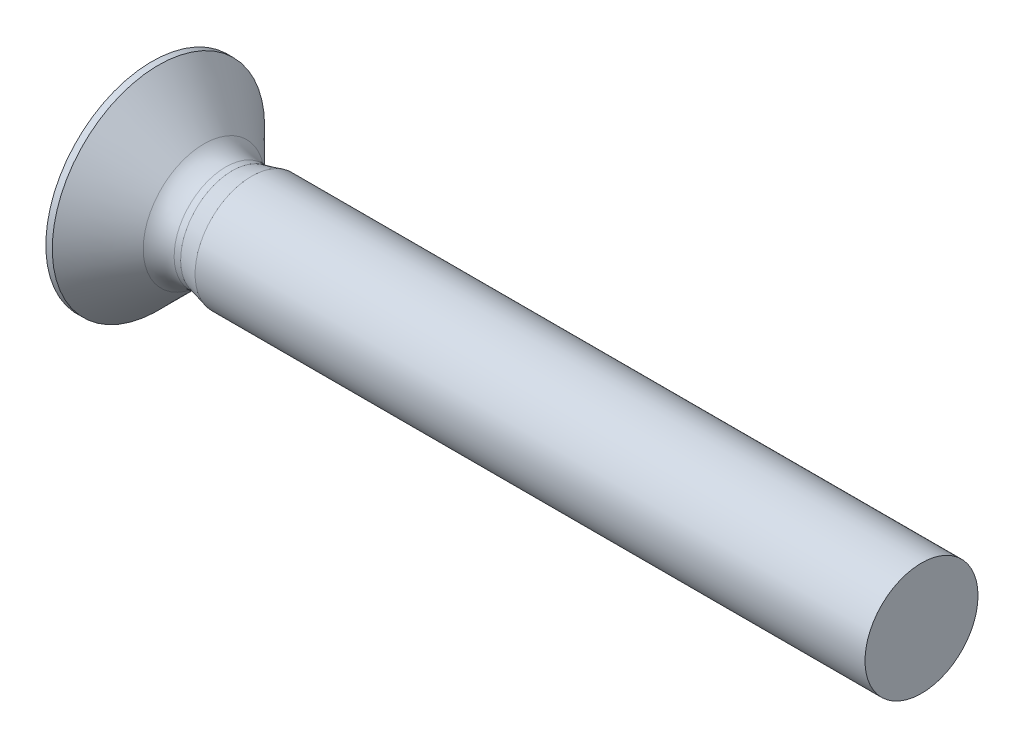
ISO-10303-21;
HEADER;
FILE_DESCRIPTION(('STEP AP214'),'2;1');
FILE_NAME('part.step','',(''),(''),'','','');
FILE_SCHEMA(('AUTOMOTIVE_DESIGN { 1 0 10303 214 1 1 1 1 }'));
ENDSEC;
DATA;
#1=APPLICATION_CONTEXT('core data for automotive mechanical design processes');
#2=APPLICATION_PROTOCOL_DEFINITION('international standard','automotive_design',2000,#1);
#3=PRODUCT_CONTEXT('',#1,'mechanical');
#4=PRODUCT('Part','Part','',(#3));
#5=PRODUCT_RELATED_PRODUCT_CATEGORY('part','',(#4));
#6=PRODUCT_DEFINITION_FORMATION('','',#4);
#7=PRODUCT_DEFINITION_CONTEXT('part definition',#1,'design');
#8=PRODUCT_DEFINITION('design','',#6,#7);
#9=PRODUCT_DEFINITION_SHAPE('','',#8);
#10=(LENGTH_UNIT() NAMED_UNIT(*) SI_UNIT(.MILLI.,.METRE.));
#11=(NAMED_UNIT(*) PLANE_ANGLE_UNIT() SI_UNIT($,.RADIAN.));
#12=(NAMED_UNIT(*) SI_UNIT($,.STERADIAN.) SOLID_ANGLE_UNIT());
#13=UNCERTAINTY_MEASURE_WITH_UNIT(LENGTH_MEASURE(1.E-05),#10,'distance_accuracy_value','');
#14=(GEOMETRIC_REPRESENTATION_CONTEXT(3) GLOBAL_UNCERTAINTY_ASSIGNED_CONTEXT((#13)) GLOBAL_UNIT_ASSIGNED_CONTEXT((#10,
#11,#12)) REPRESENTATION_CONTEXT('',''));
#15=CARTESIAN_POINT('',(0.,0.,0.));
#16=DIRECTION('',(0.,0.,1.));
#17=DIRECTION('',(1.,0.,0.));
#18=AXIS2_PLACEMENT_3D('',#15,#16,#17);
#19=CARTESIAN_POINT('',(-43.4,15.775,15.5));
#20=DIRECTION('',(0.,-1.,0.));
#21=DIRECTION('',(0.,0.,-1.));
#22=AXIS2_PLACEMENT_3D('',#19,#20,#21);
#23=PLANE('',#22);
#24=CARTESIAN_POINT('',(-44.016003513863,15.775,15.225));
#25=CARTESIAN_POINT('',(-44.0105239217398,15.775,15.1106534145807));
#26=CARTESIAN_POINT('',(-44.000493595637,15.775,14.996615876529));
#27=B_SPLINE_CURVE_WITH_KNOTS('',2,(#24,#25,#26),.UNSPECIFIED.,.F.,.F.,(3,3),(0.,1.),.UNSPECIFIED.);
#28=CARTESIAN_POINT('',(-44.016003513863,15.775,15.225));
#29=VERTEX_POINT('',#28);
#30=CARTESIAN_POINT('',(-44.0004935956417,15.775,14.9966158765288));
#31=VERTEX_POINT('',#30);
#32=EDGE_CURVE('E86',#29,#31,#27,.T.);
#33=ORIENTED_EDGE('',*,*,#32,.T.);
#34=CARTESIAN_POINT('',(-44.0004935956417,15.775,14.9966158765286));
#35=CARTESIAN_POINT('',(-43.9853538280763,15.775,14.8248425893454));
#36=CARTESIAN_POINT('',(-43.96261849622,15.775,14.6544321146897));
#37=CARTESIAN_POINT('',(-43.9019567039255,15.775,14.3163367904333));
#38=CARTESIAN_POINT('',(-43.8640302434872,15.775,14.1486519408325));
#39=CARTESIAN_POINT('',(-43.818508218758,15.775,13.9823299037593));
#40=B_SPLINE_CURVE_WITH_KNOTS('',3,(#34,#35,#36,#37,#38,#39),.UNSPECIFIED.,.F.,.F.,(4,2,4),(0.,
0.515761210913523,1.03152242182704),.UNSPECIFIED.);
#41=CARTESIAN_POINT('',(-43.8185082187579,15.7750000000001,13.9823299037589));
#42=VERTEX_POINT('',#41);
#43=EDGE_CURVE('E21',#31,#42,#40,.T.);
#44=ORIENTED_EDGE('',*,*,#43,.T.);
#45=DIRECTION('',(0.839314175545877,0.,0.54364668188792));
#46=VECTOR('',#45,1.);
#47=CARTESIAN_POINT('',(-41.9,15.775,15.225));
#48=LINE('',#47,#46);
#49=CARTESIAN_POINT('',(-41.9,15.775,15.225));
#50=VERTEX_POINT('',#49);
#51=EDGE_CURVE('E99',#50,#42,#48,.F.);
#52=ORIENTED_EDGE('',*,*,#51,.F.);
#53=DIRECTION('',(1.,0.,0.));
#54=VECTOR('',#53,1.);
#55=CARTESIAN_POINT('',(-43.4,15.775,15.225));
#56=LINE('',#55,#54);
#57=EDGE_CURVE('E97',#50,#29,#56,.F.);
#58=ORIENTED_EDGE('',*,*,#57,.T.);
#59=EDGE_LOOP('',(#33,#44,#52,#58));
#60=FACE_BOUND('',#59,.T.);
#61=ADVANCED_FACE('F17',(#60),#23,.T.);
#62=CARTESIAN_POINT('',(-41.9,15.5,15.225));
#63=DIRECTION('',(-0.54364668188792,0.,0.839314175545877));
#64=DIRECTION('',(0.839314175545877,0.,0.54364668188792));
#65=AXIS2_PLACEMENT_3D('',#62,#63,#64);
#66=PLANE('',#65);
#67=ORIENTED_EDGE('',*,*,#51,.T.);
#68=CARTESIAN_POINT('',(-43.8185082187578,15.7750000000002,13.9823299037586));
#69=CARTESIAN_POINT('',(-43.8223696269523,15.6833333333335,13.9798287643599));
#70=CARTESIAN_POINT('',(-43.8243003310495,15.5916666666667,13.9785781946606));
#71=CARTESIAN_POINT('',(-43.8243003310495,15.4083333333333,13.9785781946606));
#72=CARTESIAN_POINT('',(-43.8223696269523,15.3166666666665,13.9798287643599));
#73=CARTESIAN_POINT('',(-43.8185082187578,15.2249999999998,13.9823299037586));
#74=B_SPLINE_CURVE_WITH_KNOTS('',3,(#68,#69,#70,#71,#72,#73),.UNSPECIFIED.,.F.,.F.,(4,2,4),(0.,
0.27508657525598,0.550173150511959),.UNSPECIFIED.);
#75=CARTESIAN_POINT('',(-43.8185082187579,15.2249999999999,13.9823299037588));
#76=VERTEX_POINT('',#75);
#77=EDGE_CURVE('E103',#42,#76,#74,.T.);
#78=ORIENTED_EDGE('',*,*,#77,.T.);
#79=DIRECTION('',(0.839314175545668,0.,0.543646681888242));
#80=VECTOR('',#79,1.);
#81=CARTESIAN_POINT('',(-43.818508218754,15.225,13.98232990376));
#82=LINE('',#81,#80);
#83=CARTESIAN_POINT('',(-41.9000000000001,15.2250000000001,15.225));
#84=VERTEX_POINT('',#83);
#85=EDGE_CURVE('E108',#76,#84,#82,.T.);
#86=ORIENTED_EDGE('',*,*,#85,.T.);
#87=DIRECTION('',(0.,1.,0.));
#88=VECTOR('',#87,1.);
#89=CARTESIAN_POINT('',(-41.9,15.5,15.225));
#90=LINE('',#89,#88);
#91=EDGE_CURVE('E230',#84,#50,#90,.T.);
#92=ORIENTED_EDGE('',*,*,#91,.T.);
#93=EDGE_LOOP('',(#67,#78,#86,#92));
#94=FACE_BOUND('',#93,.T.);
#95=ADVANCED_FACE('F347',(#94),#66,.T.);
#96=CARTESIAN_POINT('',(-43.4,15.5,15.225));
#97=DIRECTION('',(0.,0.,-1.));
#98=DIRECTION('',(0.,1.,0.));
#99=AXIS2_PLACEMENT_3D('',#96,#97,#98);
#100=PLANE('',#99);
#101=ORIENTED_EDGE('',*,*,#57,.F.);
#102=DIRECTION('',(0.839314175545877,-0.54364668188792,0.));
#103=VECTOR('',#102,1.);
#104=CARTESIAN_POINT('',(-41.9,15.775,15.225));
#105=LINE('',#104,#103);
#106=CARTESIAN_POINT('',(-43.8185067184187,17.0176684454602,15.225));
#107=VERTEX_POINT('',#106);
#108=EDGE_CURVE('E106',#107,#50,#105,.T.);
#109=ORIENTED_EDGE('',*,*,#108,.F.);
#110=CARTESIAN_POINT('',(-44.0160035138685,15.7750000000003,15.225));
#111=CARTESIAN_POINT('',(-44.0134825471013,15.8276109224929,15.225));
#112=CARTESIAN_POINT('',(-44.0102377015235,15.8801871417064,15.225));
#113=CARTESIAN_POINT('',(-44.0023124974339,15.9851122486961,15.225));
#114=CARTESIAN_POINT('',(-43.9976353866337,16.037461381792,15.225));
#115=CARTESIAN_POINT('',(-43.9868546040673,16.1419331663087,15.225));
#116=CARTESIAN_POINT('',(-43.9807530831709,16.1940560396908,15.225));
#117=CARTESIAN_POINT('',(-43.967129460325,16.2980759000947,15.225));
#118=CARTESIAN_POINT('',(-43.9596084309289,16.3499730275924,15.225));
#119=CARTESIAN_POINT('',(-43.9431484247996,16.4535419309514,15.225));
#120=CARTESIAN_POINT('',(-43.9342094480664,16.5052137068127,15.225));
#121=CARTESIAN_POINT('',(-43.9149130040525,16.6083319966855,15.225));
#122=CARTESIAN_POINT('',(-43.904554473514,16.6597783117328,15.225));
#123=CARTESIAN_POINT('',(-43.8824151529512,16.7624449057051,15.225));
#124=CARTESIAN_POINT('',(-43.8706322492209,16.8136647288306,15.225));
#125=CARTESIAN_POINT('',(-43.8456375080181,16.915877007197,15.225));
#126=CARTESIAN_POINT('',(-43.8324225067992,16.9668686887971,15.225));
#127=CARTESIAN_POINT('',(-43.818508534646,17.0176689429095,15.225));
#128=B_SPLINE_CURVE_WITH_KNOTS('',3,(#110,#111,#112,#113,#114,#115,#116,#117,#118,#119,#120,
#121,#122,#123,#124,#125,#126,#127),.UNSPECIFIED.,.F.,.F.,(4,2,2,2,2,2,2,2,4),(0.,
0.158008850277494,0.3156620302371,0.473078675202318,0.630376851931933,0.787675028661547,
0.945091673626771,1.10274485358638,1.26075370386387),.UNSPECIFIED.);
#129=EDGE_CURVE('E91',#29,#107,#128,.T.);
#130=ORIENTED_EDGE('',*,*,#129,.F.);
#131=EDGE_LOOP('',(#101,#109,#130));
#132=FACE_BOUND('',#131,.T.);
#133=ADVANCED_FACE('F105',(#132),#100,.F.);
#134=CARTESIAN_POINT('',(-43.4,15.225,15.5));
#135=DIRECTION('',(0.,-1.,0.));
#136=DIRECTION('',(0.,0.,-1.));
#137=AXIS2_PLACEMENT_3D('',#134,#135,#136);
#138=PLANE('',#137);
#139=DIRECTION('',(1.,0.,0.));
#140=VECTOR('',#139,1.);
#141=CARTESIAN_POINT('',(-43.4,15.225,15.225));
#142=LINE('',#141,#140);
#143=CARTESIAN_POINT('',(-44.0160035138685,15.2249999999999,15.2249999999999));
#144=VERTEX_POINT('',#143);
#145=EDGE_CURVE('E211',#144,#84,#142,.T.);
#146=ORIENTED_EDGE('',*,*,#145,.T.);
#147=ORIENTED_EDGE('',*,*,#85,.F.);
#148=CARTESIAN_POINT('',(-44.0160035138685,15.225,15.2249999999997));
#149=CARTESIAN_POINT('',(-44.0134825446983,15.225,15.1723890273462));
#150=CARTESIAN_POINT('',(-44.0102376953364,15.225,15.1198127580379));
#151=CARTESIAN_POINT('',(-44.0023124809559,15.225,15.0148875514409));
#152=CARTESIAN_POINT('',(-43.997635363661,15.225,14.9625383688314));
#153=CARTESIAN_POINT('',(-43.9868545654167,15.225,14.8580664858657));
#154=CARTESIAN_POINT('',(-43.9807530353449,15.225,14.8059435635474));
#155=CARTESIAN_POINT('',(-43.9671293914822,15.225,14.701923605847));
#156=CARTESIAN_POINT('',(-43.9596083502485,15.225,14.6500264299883));
#157=CARTESIAN_POINT('',(-43.9431483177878,15.225,14.5464574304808));
#158=CARTESIAN_POINT('',(-43.9342093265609,15.225,14.4947856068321));
#159=CARTESIAN_POINT('',(-43.9149128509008,15.225,14.3916672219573));
#160=CARTESIAN_POINT('',(-43.904554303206,15.225,14.3402208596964));
#161=CARTESIAN_POINT('',(-43.882414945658,15.225,14.2375541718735));
#162=CARTESIAN_POINT('',(-43.8706320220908,15.225,14.1863343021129));
#163=CARTESIAN_POINT('',(-43.8456372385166,15.225,14.0841219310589));
#164=CARTESIAN_POINT('',(-43.8324222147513,15.225,14.0331302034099));
#165=CARTESIAN_POINT('',(-43.818508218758,15.225,13.9823299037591));
#166=B_SPLINE_CURVE_WITH_KNOTS('',3,(#148,#149,#150,#151,#152,#153,#154,#155,#156,#157,#158,
#159,#160,#161,#162,#163,#164,#165),.UNSPECIFIED.,.F.,.F.,(4,2,2,2,2,2,2,2,4),(0.,
0.158009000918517,0.315662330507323,0.473079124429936,0.630377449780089,0.787675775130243,
0.945092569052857,1.10274589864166,1.26075489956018),.UNSPECIFIED.);
#167=EDGE_CURVE('E111',#144,#76,#166,.T.);
#168=ORIENTED_EDGE('',*,*,#167,.F.);
#169=EDGE_LOOP('',(#146,#147,#168));
#170=FACE_BOUND('',#169,.T.);
#171=ADVANCED_FACE('F319',(#170),#138,.F.);
#172=CARTESIAN_POINT('',(-41.9,15.775,15.5));
#173=DIRECTION('',(-0.54364668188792,-0.839314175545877,0.));
#174=DIRECTION('',(0.839314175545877,-0.54364668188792,0.));
#175=AXIS2_PLACEMENT_3D('',#172,#173,#174);
#176=PLANE('',#175);
#177=DIRECTION('',(0.839314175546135,-0.543646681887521,0.));
#178=VECTOR('',#177,1.);
#179=CARTESIAN_POINT('',(-43.818504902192,17.01766794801,15.775));
#180=LINE('',#179,#178);
#181=CARTESIAN_POINT('',(-43.818506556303,17.0176690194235,15.7750000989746));
#182=VERTEX_POINT('',#181);
#183=CARTESIAN_POINT('',(-41.9000000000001,15.775,15.7749999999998));
#184=VERTEX_POINT('',#183);
#185=EDGE_CURVE('E205',#182,#184,#180,.T.);
#186=ORIENTED_EDGE('',*,*,#185,.F.);
#187=CARTESIAN_POINT('',(-43.8185082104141,17.017670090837,15.7750001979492));
#188=CARTESIAN_POINT('',(-43.822369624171,17.0201712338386,15.6833334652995));
#189=CARTESIAN_POINT('',(-43.8243003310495,17.0214218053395,15.5916667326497));
#190=CARTESIAN_POINT('',(-43.8243003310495,17.0214218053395,15.4083332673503));
#191=CARTESIAN_POINT('',(-43.822369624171,17.0201712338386,15.3166665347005));
#192=CARTESIAN_POINT('',(-43.8185082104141,17.017670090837,15.2249998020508));
#193=B_SPLINE_CURVE_WITH_KNOTS('',3,(#187,#188,#189,#190,#191,#192),.UNSPECIFIED.,.F.,.F.,(4,2,
4),(0.,0.275086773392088,0.550173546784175),.UNSPECIFIED.);
#194=EDGE_CURVE('E214',#182,#107,#193,.T.);
#195=ORIENTED_EDGE('',*,*,#194,.T.);
#196=ORIENTED_EDGE('',*,*,#108,.T.);
#197=DIRECTION('',(0.,0.,1.));
#198=VECTOR('',#197,1.);
#199=CARTESIAN_POINT('',(-41.9,15.775,15.5));
#200=LINE('',#199,#198);
#201=EDGE_CURVE('E218',#50,#184,#200,.T.);
#202=ORIENTED_EDGE('',*,*,#201,.T.);
#203=EDGE_LOOP('',(#186,#195,#196,#202));
#204=FACE_BOUND('',#203,.T.);
#205=ADVANCED_FACE('F315',(#204),#176,.T.);
#206=CARTESIAN_POINT('',(-43.4,15.5,15.225));
#207=DIRECTION('',(0.,0.,-1.));
#208=DIRECTION('',(0.,1.,0.));
#209=AXIS2_PLACEMENT_3D('',#206,#207,#208);
#210=PLANE('',#209);
#211=DIRECTION('',(-0.839314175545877,-0.54364668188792,0.));
#212=VECTOR('',#211,1.);
#213=CARTESIAN_POINT('',(-44.1,13.8,15.225));
#214=LINE('',#213,#212);
#215=CARTESIAN_POINT('',(-43.8185082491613,13.9823300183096,15.224999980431));
#216=VERTEX_POINT('',#215);
#217=EDGE_CURVE('E199',#84,#216,#214,.T.);
#218=ORIENTED_EDGE('',*,*,#217,.F.);
#219=ORIENTED_EDGE('',*,*,#145,.F.);
#220=CARTESIAN_POINT('',(-43.8185082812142,13.9823301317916,15.225));
#221=CARTESIAN_POINT('',(-43.832422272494,14.0331304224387,15.225));
#222=CARTESIAN_POINT('',(-43.8456372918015,14.0841221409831,15.225));
#223=CARTESIAN_POINT('',(-43.8706320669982,14.1863344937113,15.225));
#224=CARTESIAN_POINT('',(-43.8824149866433,14.2375543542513,15.225));
#225=CARTESIAN_POINT('',(-43.9045543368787,14.3402210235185,15.225));
#226=CARTESIAN_POINT('',(-43.9149128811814,14.3916673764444,15.225));
#227=CARTESIAN_POINT('',(-43.9342093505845,14.4947857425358,15.225));
#228=CARTESIAN_POINT('',(-43.9431483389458,14.5464575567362,15.225));
#229=CARTESIAN_POINT('',(-43.9596083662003,14.6500265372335,15.225));
#230=CARTESIAN_POINT('',(-43.9671294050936,14.7019237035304,15.225));
#231=CARTESIAN_POINT('',(-43.9807530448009,14.8059436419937,15.225));
#232=CARTESIAN_POINT('',(-43.9868545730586,14.8580665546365,15.225));
#233=CARTESIAN_POINT('',(-43.9976353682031,14.9625384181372,15.225));
#234=CARTESIAN_POINT('',(-44.0023124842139,15.0148875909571,15.225));
#235=CARTESIAN_POINT('',(-44.0102376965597,15.1198127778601,15.225));
#236=CARTESIAN_POINT('',(-44.0134825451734,15.1723890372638,15.225));
#237=CARTESIAN_POINT('',(-44.0160035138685,15.2249999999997,15.225));
#238=B_SPLINE_CURVE_WITH_KNOTS('',3,(#220,#221,#222,#223,#224,#225,#226,#227,#228,#229,#230,
#231,#232,#233,#234,#235,#236,#237),.UNSPECIFIED.,.F.,.F.,(4,2,2,2,2,2,2,2,4),(0.,
0.158008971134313,0.315662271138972,0.473079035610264,0.630377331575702,0.787675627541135,
0.945092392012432,1.10274569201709,1.26075466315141),.UNSPECIFIED.);
#239=EDGE_CURVE('E208',#216,#144,#238,.T.);
#240=ORIENTED_EDGE('',*,*,#239,.F.);
#241=EDGE_LOOP('',(#218,#219,#240));
#242=FACE_BOUND('',#241,.T.);
#243=ADVANCED_FACE('F310',(#242),#210,.F.);
#244=CARTESIAN_POINT('',(-43.4,15.5,15.775));
#245=DIRECTION('',(0.,0.,-1.));
#246=DIRECTION('',(0.,1.,0.));
#247=AXIS2_PLACEMENT_3D('',#244,#245,#246);
#248=PLANE('',#247);
#249=DIRECTION('',(1.,0.,0.));
#250=VECTOR('',#249,1.);
#251=CARTESIAN_POINT('',(-43.4,15.775,15.775));
#252=LINE('',#251,#250);
#253=CARTESIAN_POINT('',(-44.0160035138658,15.7750000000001,15.775));
#254=VERTEX_POINT('',#253);
#255=EDGE_CURVE('E193',#254,#184,#252,.T.);
#256=ORIENTED_EDGE('',*,*,#255,.F.);
#257=CARTESIAN_POINT('',(-44.0160035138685,15.7750000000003,15.775));
#258=CARTESIAN_POINT('',(-44.0134825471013,15.8276109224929,15.775));
#259=CARTESIAN_POINT('',(-44.0102377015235,15.8801871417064,15.775));
#260=CARTESIAN_POINT('',(-44.0023124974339,15.9851122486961,15.775));
#261=CARTESIAN_POINT('',(-43.9976353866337,16.037461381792,15.775));
#262=CARTESIAN_POINT('',(-43.9868546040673,16.1419331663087,15.775));
#263=CARTESIAN_POINT('',(-43.9807530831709,16.1940560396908,15.775));
#264=CARTESIAN_POINT('',(-43.967129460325,16.2980759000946,15.775));
#265=CARTESIAN_POINT('',(-43.9596084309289,16.3499730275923,15.775));
#266=CARTESIAN_POINT('',(-43.9431484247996,16.4535419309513,15.775));
#267=CARTESIAN_POINT('',(-43.9342094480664,16.5052137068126,15.775));
#268=CARTESIAN_POINT('',(-43.9149130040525,16.6083319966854,15.775));
#269=CARTESIAN_POINT('',(-43.904554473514,16.6597783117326,15.775));
#270=CARTESIAN_POINT('',(-43.8824151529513,16.7624449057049,15.775));
#271=CARTESIAN_POINT('',(-43.8706322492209,16.8136647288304,15.775));
#272=CARTESIAN_POINT('',(-43.8456375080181,16.9158770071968,15.775));
#273=CARTESIAN_POINT('',(-43.8324225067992,16.9668686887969,15.775));
#274=CARTESIAN_POINT('',(-43.8185085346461,17.0176689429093,15.775));
#275=B_SPLINE_CURVE_WITH_KNOTS('',3,(#257,#258,#259,#260,#261,#262,#263,#264,#265,#266,#267,
#268,#269,#270,#271,#272,#273,#274),.UNSPECIFIED.,.F.,.F.,(4,2,2,2,2,2,2,2,4),(0.,
0.158008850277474,0.315662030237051,0.473078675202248,0.630376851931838,0.787675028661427,
0.945091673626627,1.1027448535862,1.26075370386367),.UNSPECIFIED.);
#276=EDGE_CURVE('E202',#254,#182,#275,.T.);
#277=ORIENTED_EDGE('',*,*,#276,.T.);
#278=ORIENTED_EDGE('',*,*,#185,.T.);
#279=EDGE_LOOP('',(#256,#277,#278));
#280=FACE_BOUND('',#279,.T.);
#281=ADVANCED_FACE('F307',(#280),#248,.T.);
#282=CARTESIAN_POINT('',(-44.1,13.8,15.5));
#283=DIRECTION('',(-0.54364668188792,0.839314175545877,0.));
#284=DIRECTION('',(-0.839314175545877,-0.54364668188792,0.));
#285=AXIS2_PLACEMENT_3D('',#282,#283,#284);
#286=PLANE('',#285);
#287=ORIENTED_EDGE('',*,*,#217,.T.);
#288=CARTESIAN_POINT('',(-43.8185082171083,13.9823299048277,15.2249999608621));
#289=CARTESIAN_POINT('',(-43.8223696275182,13.979828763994,15.31666666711));
#290=CARTESIAN_POINT('',(-43.8243003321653,13.9785781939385,15.4083333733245));
#291=CARTESIAN_POINT('',(-43.824300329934,13.9785781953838,15.5916667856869));
#292=CARTESIAN_POINT('',(-43.8223696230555,13.9798287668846,15.6833334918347));
#293=CARTESIAN_POINT('',(-43.8185082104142,13.9823299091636,15.7750001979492));
#294=B_SPLINE_CURVE_WITH_KNOTS('',3,(#288,#289,#290,#291,#292,#293),.UNSPECIFIED.,.F.,.F.,(4,2,
4),(0.,0.275086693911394,0.550173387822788),.UNSPECIFIED.);
#295=CARTESIAN_POINT('',(-43.8185083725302,13.9823304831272,15.7750000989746));
#296=VERTEX_POINT('',#295);
#297=EDGE_CURVE('E196',#216,#296,#294,.T.);
#298=ORIENTED_EDGE('',*,*,#297,.T.);
#299=DIRECTION('',(-0.839314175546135,-0.543646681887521,0.));
#300=VECTOR('',#299,1.);
#301=CARTESIAN_POINT('',(-41.9,15.225,15.775));
#302=LINE('',#301,#300);
#303=CARTESIAN_POINT('',(-41.9000000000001,15.225,15.7749999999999));
#304=VERTEX_POINT('',#303);
#305=EDGE_CURVE('E182',#304,#296,#302,.T.);
#306=ORIENTED_EDGE('',*,*,#305,.F.);
#307=DIRECTION('',(0.,0.,1.));
#308=VECTOR('',#307,1.);
#309=CARTESIAN_POINT('',(-41.9,15.225,15.775));
#310=LINE('',#309,#308);
#311=EDGE_CURVE('E185',#84,#304,#310,.T.);
#312=ORIENTED_EDGE('',*,*,#311,.F.);
#313=EDGE_LOOP('',(#287,#298,#306,#312));
#314=FACE_BOUND('',#313,.T.);
#315=ADVANCED_FACE('F281',(#314),#286,.T.);
#316=CARTESIAN_POINT('',(-43.4,15.775,15.5));
#317=DIRECTION('',(0.,-1.,0.));
#318=DIRECTION('',(0.,0.,-1.));
#319=AXIS2_PLACEMENT_3D('',#316,#317,#318);
#320=PLANE('',#319);
#321=DIRECTION('',(-0.839314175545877,0.,0.54364668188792));
#322=VECTOR('',#321,1.);
#323=CARTESIAN_POINT('',(-44.1,15.775,17.2));
#324=LINE('',#323,#322);
#325=CARTESIAN_POINT('',(-43.8185082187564,15.775,17.0176700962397));
#326=VERTEX_POINT('',#325);
#327=EDGE_CURVE('E171',#326,#184,#324,.F.);
#328=ORIENTED_EDGE('',*,*,#327,.F.);
#329=CARTESIAN_POINT('',(-43.8185082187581,15.775,17.0176700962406));
#330=CARTESIAN_POINT('',(-43.8324222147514,15.775,16.9668697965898));
#331=CARTESIAN_POINT('',(-43.8456372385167,15.775,16.9158780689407));
#332=CARTESIAN_POINT('',(-43.8706320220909,15.775,16.8136656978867));
#333=CARTESIAN_POINT('',(-43.8824149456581,15.775,16.7624458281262));
#334=CARTESIAN_POINT('',(-43.904554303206,15.775,16.6597791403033));
#335=CARTESIAN_POINT('',(-43.9149128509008,15.775,16.6083327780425));
#336=CARTESIAN_POINT('',(-43.9342093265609,15.775,16.5052143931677));
#337=CARTESIAN_POINT('',(-43.9431483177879,15.775,16.4535425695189));
#338=CARTESIAN_POINT('',(-43.9596083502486,15.775,16.3499735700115));
#339=CARTESIAN_POINT('',(-43.9671293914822,15.775,16.2980763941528));
#340=CARTESIAN_POINT('',(-43.9807530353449,15.775,16.1940564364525));
#341=CARTESIAN_POINT('',(-43.9868545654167,15.775,16.1419335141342));
#342=CARTESIAN_POINT('',(-43.997635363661,15.775,16.0374616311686));
#343=CARTESIAN_POINT('',(-44.0023124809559,15.775,15.985112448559));
#344=CARTESIAN_POINT('',(-44.0102376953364,15.775,15.880187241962));
#345=CARTESIAN_POINT('',(-44.0134825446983,15.775,15.8276109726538));
#346=CARTESIAN_POINT('',(-44.0160035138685,15.775,15.7750000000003));
#347=B_SPLINE_CURVE_WITH_KNOTS('',3,(#329,#330,#331,#332,#333,#334,#335,#336,#337,#338,#339,
#340,#341,#342,#343,#344,#345,#346),.UNSPECIFIED.,.F.,.F.,(4,2,2,2,2,2,2,2,4),(0.,
0.158009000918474,0.315662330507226,0.473079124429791,0.630377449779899,0.787675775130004,
0.945092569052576,1.10274589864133,1.2607548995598),.UNSPECIFIED.);
#348=EDGE_CURVE('E190',#326,#254,#347,.T.);
#349=ORIENTED_EDGE('',*,*,#348,.T.);
#350=ORIENTED_EDGE('',*,*,#255,.T.);
#351=EDGE_LOOP('',(#328,#349,#350));
#352=FACE_BOUND('',#351,.T.);
#353=ADVANCED_FACE('F276',(#352),#320,.T.);
#354=CARTESIAN_POINT('',(-41.9,15.5,15.775));
#355=DIRECTION('',(-1.,0.,0.));
#356=DIRECTION('',(0.,0.,1.));
#357=AXIS2_PLACEMENT_3D('',#354,#355,#356);
#358=PLANE('',#357);
#359=ORIENTED_EDGE('',*,*,#91,.F.);
#360=ORIENTED_EDGE('',*,*,#311,.T.);
#361=DIRECTION('',(0.,1.,0.));
#362=VECTOR('',#361,1.);
#363=CARTESIAN_POINT('',(-41.9000000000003,15.5,15.7749999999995));
#364=LINE('',#363,#362);
#365=EDGE_CURVE('E174',#184,#304,#364,.F.);
#366=ORIENTED_EDGE('',*,*,#365,.F.);
#367=ORIENTED_EDGE('',*,*,#201,.F.);
#368=EDGE_LOOP('',(#359,#360,#366,#367));
#369=FACE_BOUND('',#368,.T.);
#370=ADVANCED_FACE('F272',(#369),#358,.T.);
#371=CARTESIAN_POINT('',(-43.4,15.5,15.775));
#372=DIRECTION('',(0.,0.,-1.));
#373=DIRECTION('',(0.,1.,0.));
#374=AXIS2_PLACEMENT_3D('',#371,#372,#373);
#375=PLANE('',#374);
#376=ORIENTED_EDGE('',*,*,#305,.T.);
#377=CARTESIAN_POINT('',(-43.8185085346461,13.9823310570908,15.775));
#378=CARTESIAN_POINT('',(-43.8324225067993,14.0331313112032,15.775));
#379=CARTESIAN_POINT('',(-43.8456375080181,14.0841229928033,15.775));
#380=CARTESIAN_POINT('',(-43.870632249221,14.1863352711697,15.775));
#381=CARTESIAN_POINT('',(-43.8824151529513,14.2375550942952,15.775));
#382=CARTESIAN_POINT('',(-43.904554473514,14.3402216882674,15.775));
#383=CARTESIAN_POINT('',(-43.9149130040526,14.3916680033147,15.775));
#384=CARTESIAN_POINT('',(-43.9342094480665,14.4947862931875,15.775));
#385=CARTESIAN_POINT('',(-43.9431484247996,14.5464580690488,15.775));
#386=CARTESIAN_POINT('',(-43.9596084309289,14.6500269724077,15.775));
#387=CARTESIAN_POINT('',(-43.9671294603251,14.7019240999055,15.775));
#388=CARTESIAN_POINT('',(-43.9807530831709,14.8059439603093,15.775));
#389=CARTESIAN_POINT('',(-43.9868546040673,14.8580668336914,15.775));
#390=CARTESIAN_POINT('',(-43.9976353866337,14.9625386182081,15.775));
#391=CARTESIAN_POINT('',(-44.0023124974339,15.0148877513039,15.775));
#392=CARTESIAN_POINT('',(-44.0102377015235,15.1198128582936,15.775));
#393=CARTESIAN_POINT('',(-44.0134825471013,15.1723890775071,15.775));
#394=CARTESIAN_POINT('',(-44.0160035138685,15.2249999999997,15.775));
#395=B_SPLINE_CURVE_WITH_KNOTS('',3,(#377,#378,#379,#380,#381,#382,#383,#384,#385,#386,#387,
#388,#389,#390,#391,#392,#393,#394),.UNSPECIFIED.,.F.,.F.,(4,2,2,2,2,2,2,2,4),(0.,
0.158008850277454,0.315662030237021,0.473078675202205,0.63037685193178,0.787675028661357,
0.94509167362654,1.1027448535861,1.26075370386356),.UNSPECIFIED.);
#396=CARTESIAN_POINT('',(-44.0160035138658,15.2249999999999,15.775));
#397=VERTEX_POINT('',#396);
#398=EDGE_CURVE('E175',#296,#397,#395,.T.);
#399=ORIENTED_EDGE('',*,*,#398,.T.);
#400=DIRECTION('',(1.,0.,0.));
#401=VECTOR('',#400,1.);
#402=CARTESIAN_POINT('',(-43.4,15.225,15.775));
#403=LINE('',#402,#401);
#404=EDGE_CURVE('E163',#397,#304,#403,.T.);
#405=ORIENTED_EDGE('',*,*,#404,.T.);
#406=EDGE_LOOP('',(#376,#399,#405));
#407=FACE_BOUND('',#406,.T.);
#408=ADVANCED_FACE('F267',(#407),#375,.T.);
#409=CARTESIAN_POINT('',(-44.1,15.5,17.2));
#410=DIRECTION('',(-0.54364668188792,0.,-0.839314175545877));
#411=DIRECTION('',(-0.839314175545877,0.,0.54364668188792));
#412=AXIS2_PLACEMENT_3D('',#409,#410,#411);
#413=PLANE('',#412);
#414=DIRECTION('',(-0.839314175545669,0.,0.543646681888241));
#415=VECTOR('',#414,1.);
#416=CARTESIAN_POINT('',(-41.9,15.225,15.775));
#417=LINE('',#416,#415);
#418=CARTESIAN_POINT('',(-43.818508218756,15.2249999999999,17.0176700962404));
#419=VERTEX_POINT('',#418);
#420=EDGE_CURVE('E155',#304,#419,#417,.T.);
#421=ORIENTED_EDGE('',*,*,#420,.T.);
#422=CARTESIAN_POINT('',(-43.818508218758,15.2249999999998,17.0176700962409));
#423=CARTESIAN_POINT('',(-43.8223696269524,15.3166666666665,17.0201712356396));
#424=CARTESIAN_POINT('',(-43.8243003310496,15.4083333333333,17.0214218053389));
#425=CARTESIAN_POINT('',(-43.8243003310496,15.5916666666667,17.0214218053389));
#426=CARTESIAN_POINT('',(-43.8223696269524,15.6833333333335,17.0201712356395));
#427=CARTESIAN_POINT('',(-43.818508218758,15.7750000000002,17.0176700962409));
#428=B_SPLINE_CURVE_WITH_KNOTS('',3,(#422,#423,#424,#425,#426,#427),.UNSPECIFIED.,.F.,.F.,(4,2,
4),(0.,0.275086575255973,0.550173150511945),.UNSPECIFIED.);
#429=EDGE_CURVE('E168',#419,#326,#428,.T.);
#430=ORIENTED_EDGE('',*,*,#429,.T.);
#431=ORIENTED_EDGE('',*,*,#327,.T.);
#432=ORIENTED_EDGE('',*,*,#365,.T.);
#433=EDGE_LOOP('',(#421,#430,#431,#432));
#434=FACE_BOUND('',#433,.T.);
#435=ADVANCED_FACE('F264',(#434),#413,.T.);
#436=CARTESIAN_POINT('',(-43.4,15.225,15.5));
#437=DIRECTION('',(0.,-1.,0.));
#438=DIRECTION('',(0.,0.,-1.));
#439=AXIS2_PLACEMENT_3D('',#436,#437,#438);
#440=PLANE('',#439);
#441=CARTESIAN_POINT('',(-43.818508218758,15.225,17.0176700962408));
#442=CARTESIAN_POINT('',(-43.8640302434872,15.225,16.8513480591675));
#443=CARTESIAN_POINT('',(-43.9019567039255,15.225,16.6836632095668));
#444=CARTESIAN_POINT('',(-43.96261849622,15.225,16.3455678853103));
#445=CARTESIAN_POINT('',(-43.9853538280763,15.225,16.1751574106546));
#446=CARTESIAN_POINT('',(-44.0004935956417,15.225,16.0033841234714));
#447=B_SPLINE_CURVE_WITH_KNOTS('',3,(#441,#442,#443,#444,#445,#446),.UNSPECIFIED.,.F.,.F.,(4,2,
4),(0.,0.515761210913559,1.03152242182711),.UNSPECIFIED.);
#448=CARTESIAN_POINT('',(-44.0004935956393,15.225,16.0033841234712));
#449=VERTEX_POINT('',#448);
#450=EDGE_CURVE('E154',#419,#449,#447,.T.);
#451=ORIENTED_EDGE('',*,*,#450,.F.);
#452=ORIENTED_EDGE('',*,*,#420,.F.);
#453=ORIENTED_EDGE('',*,*,#404,.F.);
#454=CARTESIAN_POINT('',(-44.000493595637,15.225,16.003384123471));
#455=CARTESIAN_POINT('',(-44.0105239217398,15.225,15.8893465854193));
#456=CARTESIAN_POINT('',(-44.016003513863,15.225,15.775));
#457=B_SPLINE_CURVE_WITH_KNOTS('',2,(#454,#455,#456),.UNSPECIFIED.,.F.,.F.,(3,3),(0.,1.),.UNSPECIFIED.);
#458=EDGE_CURVE('E41',#449,#397,#457,.T.);
#459=ORIENTED_EDGE('',*,*,#458,.F.);
#460=EDGE_LOOP('',(#451,#452,#453,#459));
#461=FACE_BOUND('',#460,.T.);
#462=ADVANCED_FACE('F136',(#461),#440,.F.);
#463=CARTESIAN_POINT('',(-38.27738095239,15.5,15.5));
#464=DIRECTION('',(0.,-0.479425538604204,0.877582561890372));
#465=DIRECTION('',(0.,0.877582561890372,0.479425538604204));
#466=AXIS2_PLACEMENT_3D('',#463,#464,#465);
#467=SPHERICAL_SURFACE('',#466,5.75178571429);
#468=CARTESIAN_POINT('',(-43.3291666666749,15.5,15.5));
#469=DIRECTION('',(1.,0.,0.));
#470=DIRECTION('',(0.,0.,-1.));
#471=AXIS2_PLACEMENT_3D('',#468,#469,#470);
#472=CIRCLE('',#471,2.75);
#473=CARTESIAN_POINT('',(-43.3291666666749,15.5,12.75));
#474=VERTEX_POINT('',#473);
#475=EDGE_CURVE('E151',#474,#474,#472,.T.);
#476=ORIENTED_EDGE('',*,*,#475,.F.);
#477=EDGE_LOOP('',(#476));
#478=FACE_BOUND('',#477,.T.);
#479=ORIENTED_EDGE('',*,*,#77,.F.);
#480=ORIENTED_EDGE('',*,*,#43,.F.);
#481=ORIENTED_EDGE('',*,*,#32,.F.);
#482=ORIENTED_EDGE('',*,*,#129,.T.);
#483=ORIENTED_EDGE('',*,*,#194,.F.);
#484=ORIENTED_EDGE('',*,*,#276,.F.);
#485=ORIENTED_EDGE('',*,*,#348,.F.);
#486=ORIENTED_EDGE('',*,*,#429,.F.);
#487=ORIENTED_EDGE('',*,*,#450,.T.);
#488=ORIENTED_EDGE('',*,*,#458,.T.);
#489=ORIENTED_EDGE('',*,*,#398,.F.);
#490=ORIENTED_EDGE('',*,*,#297,.F.);
#491=ORIENTED_EDGE('',*,*,#239,.T.);
#492=ORIENTED_EDGE('',*,*,#167,.T.);
#493=EDGE_LOOP('',(#479,#480,#481,#482,#483,#484,#485,#486,#487,#488,#489,#490,#491,#492));
#494=FACE_BOUND('',#493,.T.);
#495=ADVANCED_FACE('F89',(#478,#494),#467,.T.);
#496=CARTESIAN_POINT('',(-33.71458333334,15.5,15.5));
#497=DIRECTION('',(1.,0.,0.));
#498=DIRECTION('',(0.,0.,-1.));
#499=AXIS2_PLACEMENT_3D('',#496,#497,#498);
#500=CYLINDRICAL_SURFACE('',#499,2.75);
#501=CARTESIAN_POINT('',(-43.162499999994,15.5,15.5));
#502=DIRECTION('',(-1.,0.,0.));
#503=DIRECTION('',(0.,-0.4794255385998,0.877582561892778));
#504=AXIS2_PLACEMENT_3D('',#501,#502,#503);
#505=CIRCLE('',#504,2.75000000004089);
#506=CARTESIAN_POINT('',(-43.162499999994,14.1815797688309,17.913352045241));
#507=VERTEX_POINT('',#506);
#508=EDGE_CURVE('E148',#507,#507,#505,.F.);
#509=ORIENTED_EDGE('',*,*,#508,.F.);
#510=EDGE_LOOP('',(#509));
#511=FACE_BOUND('',#510,.T.);
#512=ORIENTED_EDGE('',*,*,#475,.T.);
#513=EDGE_LOOP('',(#512));
#514=FACE_BOUND('',#513,.T.);
#515=ADVANCED_FACE('F135',(#511,#514),#500,.T.);
#516=CARTESIAN_POINT('',(-43.1625000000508,15.5,15.5));
#517=DIRECTION('',(-1.,0.,0.));
#518=DIRECTION('',(0.,0.,1.));
#519=AXIS2_PLACEMENT_3D('',#516,#517,#518);
#520=CONICAL_SURFACE('',#519,2.75000000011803,0.785398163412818);
#521=ORIENTED_EDGE('',*,*,#508,.T.);
#522=EDGE_LOOP('',(#521));
#523=FACE_BOUND('',#522,.T.);
#524=CARTESIAN_POINT('',(-41.9843145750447,15.5,15.5));
#525=DIRECTION('',(1.,0.,0.));
#526=DIRECTION('',(0.,-0.479425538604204,0.877582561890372));
#527=AXIS2_PLACEMENT_3D('',#524,#525,#526);
#528=CIRCLE('',#527,1.57181457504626);
#529=CARTESIAN_POINT('',(-41.9843145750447,14.7464319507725,16.8793970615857));
#530=VERTEX_POINT('',#529);
#531=EDGE_CURVE('E146',#530,#530,#528,.F.);
#532=ORIENTED_EDGE('',*,*,#531,.T.);
#533=EDGE_LOOP('',(#532));
#534=FACE_BOUND('',#533,.T.);
#535=ADVANCED_FACE('F378',(#523,#534),#520,.T.);
#536=CARTESIAN_POINT('',(-41.4186291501,15.5,15.5));
#537=DIRECTION('',(1.,0.,0.));
#538=DIRECTION('',(0.,-0.479425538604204,0.877582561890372));
#539=AXIS2_PLACEMENT_3D('',#536,#537,#538);
#540=TOROIDAL_SURFACE('',#539,2.1375,0.8);
#541=ORIENTED_EDGE('',*,*,#531,.F.);
#542=EDGE_LOOP('',(#541));
#543=FACE_BOUND('',#542,.T.);
#544=CARTESIAN_POINT('',(-41.4186291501,15.5,15.5));
#545=DIRECTION('',(1.,0.,0.));
#546=DIRECTION('',(0.,0.,-1.));
#547=AXIS2_PLACEMENT_3D('',#544,#545,#546);
#548=CIRCLE('',#547,1.3375);
#549=CARTESIAN_POINT('',(-41.4186291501,15.5,14.1625));
#550=VERTEX_POINT('',#549);
#551=EDGE_CURVE('E383',#550,#550,#548,.T.);
#552=ORIENTED_EDGE('',*,*,#551,.F.);
#553=EDGE_LOOP('',(#552));
#554=FACE_BOUND('',#553,.T.);
#555=ADVANCED_FACE('F374',(#543,#554),#540,.F.);
#556=CARTESIAN_POINT('',(-33.71458333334,15.5,15.5));
#557=DIRECTION('',(1.,0.,0.));
#558=DIRECTION('',(0.,0.,-1.));
#559=AXIS2_PLACEMENT_3D('',#556,#557,#558);
#560=CYLINDRICAL_SURFACE('',#559,1.3375);
#561=CARTESIAN_POINT('',(-41.2499999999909,15.5,15.5));
#562=DIRECTION('',(1.,0.,0.));
#563=DIRECTION('',(0.,-0.47942553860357,0.877582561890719));
#564=AXIS2_PLACEMENT_3D('',#561,#562,#563);
#565=CIRCLE('',#564,1.33750000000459);
#566=CARTESIAN_POINT('',(-41.2499999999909,14.8587683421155,16.6737666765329));
#567=VERTEX_POINT('',#566);
#568=EDGE_CURVE('E244',#567,#567,#565,.T.);
#569=ORIENTED_EDGE('',*,*,#568,.F.);
#570=EDGE_LOOP('',(#569));
#571=FACE_BOUND('',#570,.T.);
#572=ORIENTED_EDGE('',*,*,#551,.T.);
#573=EDGE_LOOP('',(#572));
#574=FACE_BOUND('',#573,.T.);
#575=ADVANCED_FACE('F370',(#571,#574),#560,.T.);
#576=CARTESIAN_POINT('',(-23.4,15.5,16.96341463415));
#577=DIRECTION('',(1.,0.,0.));
#578=DIRECTION('',(0.,0.,-1.));
#579=AXIS2_PLACEMENT_3D('',#576,#577,#578);
#580=PLANE('',#579);
#581=CARTESIAN_POINT('',(-23.4,15.5,15.5));
#582=DIRECTION('',(1.,0.,0.));
#583=DIRECTION('',(0.,0.,-1.));
#584=AXIS2_PLACEMENT_3D('',#581,#582,#583);
#585=CIRCLE('',#584,1.46341463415);
#586=CARTESIAN_POINT('',(-23.4,15.5,14.03658536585));
#587=VERTEX_POINT('',#586);
#588=EDGE_CURVE('E32',#587,#587,#585,.F.);
#589=ORIENTED_EDGE('',*,*,#588,.F.);
#590=EDGE_LOOP('',(#589));
#591=FACE_BOUND('',#590,.T.);
#592=ADVANCED_FACE('F363',(#591),#580,.T.);
#593=CARTESIAN_POINT('',(-40.7500000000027,15.5,15.5));
#594=DIRECTION('',(1.,0.,0.));
#595=DIRECTION('',(0.,0.,-1.));
#596=AXIS2_PLACEMENT_3D('',#593,#594,#595);
#597=CONICAL_SURFACE('',#596,1.46341463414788,0.246699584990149);
#598=CARTESIAN_POINT('',(-40.75,15.5,15.5));
#599=DIRECTION('',(1.,0.,0.));
#600=DIRECTION('',(0.,0.,-1.));
#601=AXIS2_PLACEMENT_3D('',#598,#599,#600);
#602=CIRCLE('',#601,1.46341463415);
#603=CARTESIAN_POINT('',(-40.75,15.5,14.03658536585));
#604=VERTEX_POINT('',#603);
#605=EDGE_CURVE('E11',#604,#604,#602,.T.);
#606=ORIENTED_EDGE('',*,*,#605,.F.);
#607=EDGE_LOOP('',(#606));
#608=FACE_BOUND('',#607,.T.);
#609=ORIENTED_EDGE('',*,*,#568,.T.);
#610=EDGE_LOOP('',(#609));
#611=FACE_BOUND('',#610,.T.);
#612=ADVANCED_FACE('F357',(#608,#611),#597,.T.);
#613=CARTESIAN_POINT('',(-33.71458333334,15.5,15.5));
#614=DIRECTION('',(1.,0.,0.));
#615=DIRECTION('',(0.,0.,-1.));
#616=AXIS2_PLACEMENT_3D('',#613,#614,#615);
#617=CYLINDRICAL_SURFACE('',#616,1.46341463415);
#618=ORIENTED_EDGE('',*,*,#588,.T.);
#619=EDGE_LOOP('',(#618));
#620=FACE_BOUND('',#619,.T.);
#621=ORIENTED_EDGE('',*,*,#605,.T.);
#622=EDGE_LOOP('',(#621));
#623=FACE_BOUND('',#622,.T.);
#624=ADVANCED_FACE('F355',(#620,#623),#617,.T.);
#625=CLOSED_SHELL('',(#61,#95,#133,#171,#205,#243,#281,#315,#353,#370,#408,#435,#462,#495,#515,
#535,#555,#575,#592,#612,#624));
#626=MANIFOLD_SOLID_BREP('B1',#625);
#627=ADVANCED_BREP_SHAPE_REPRESENTATION('',(#18,#626),#14);
#628=SHAPE_DEFINITION_REPRESENTATION(#9,#627);
ENDSEC;
END-ISO-10303-21;
